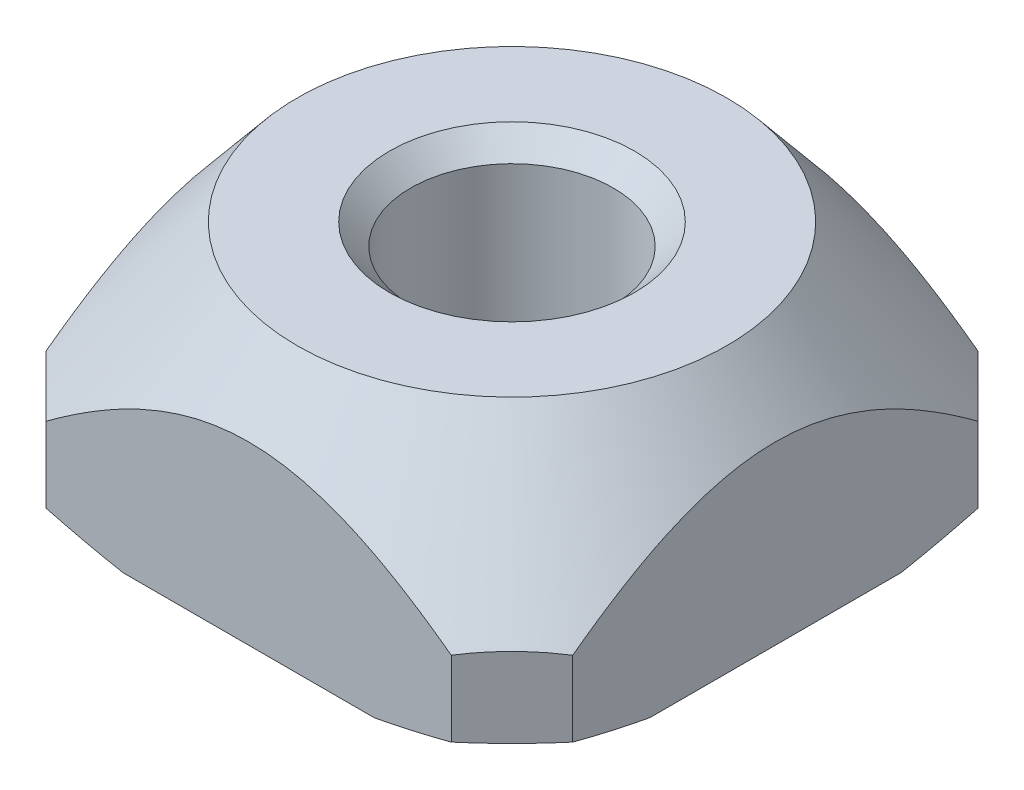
ISO-10303-21;
HEADER;
FILE_DESCRIPTION(('STEP AP214'),'2;1');
FILE_NAME('part.step','',(''),(''),'','','');
FILE_SCHEMA(('AUTOMOTIVE_DESIGN { 1 0 10303 214 1 1 1 1 }'));
ENDSEC;
DATA;
#1=APPLICATION_CONTEXT('core data for automotive mechanical design processes');
#2=APPLICATION_PROTOCOL_DEFINITION('international standard','automotive_design',2000,#1);
#3=PRODUCT_CONTEXT('',#1,'mechanical');
#4=PRODUCT('Part','Part','',(#3));
#5=PRODUCT_RELATED_PRODUCT_CATEGORY('part','',(#4));
#6=PRODUCT_DEFINITION_FORMATION('','',#4);
#7=PRODUCT_DEFINITION_CONTEXT('part definition',#1,'design');
#8=PRODUCT_DEFINITION('design','',#6,#7);
#9=PRODUCT_DEFINITION_SHAPE('','',#8);
#10=(LENGTH_UNIT() NAMED_UNIT(*) SI_UNIT(.MILLI.,.METRE.));
#11=(NAMED_UNIT(*) PLANE_ANGLE_UNIT() SI_UNIT($,.RADIAN.));
#12=(NAMED_UNIT(*) SI_UNIT($,.STERADIAN.) SOLID_ANGLE_UNIT());
#13=UNCERTAINTY_MEASURE_WITH_UNIT(LENGTH_MEASURE(1.E-05),#10,'distance_accuracy_value','');
#14=(GEOMETRIC_REPRESENTATION_CONTEXT(3) GLOBAL_UNCERTAINTY_ASSIGNED_CONTEXT((#13)) GLOBAL_UNIT_ASSIGNED_CONTEXT((#10,
#11,#12)) REPRESENTATION_CONTEXT('',''));
#15=CARTESIAN_POINT('',(0.,0.,0.));
#16=DIRECTION('',(0.,0.,1.));
#17=DIRECTION('',(1.,0.,0.));
#18=AXIS2_PLACEMENT_3D('',#15,#16,#17);
#19=CARTESIAN_POINT('',(0.,5.8,0.));
#20=DIRECTION('',(0.,-1.,0.));
#21=DIRECTION('',(0.,0.,-1.));
#22=AXIS2_PLACEMENT_3D('',#19,#20,#21);
#23=PLANE('',#22);
#24=CARTESIAN_POINT('',(0.,5.80000000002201,0.));
#25=DIRECTION('',(0.,1.,0.));
#26=DIRECTION('',(0.,0.,1.));
#27=AXIS2_PLACEMENT_3D('',#24,#25,#26);
#28=CIRCLE('',#27,3.02499999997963);
#29=CARTESIAN_POINT('',(0.,5.80000000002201,3.02499999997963));
#30=VERTEX_POINT('',#29);
#31=EDGE_CURVE('E19',#30,#30,#28,.F.);
#32=ORIENTED_EDGE('',*,*,#31,.T.);
#33=EDGE_LOOP('',(#32));
#34=FACE_BOUND('',#33,.T.);
#35=CARTESIAN_POINT('',(0.,5.8,0.));
#36=DIRECTION('',(0.,-1.,0.));
#37=DIRECTION('',(0.,0.,-1.));
#38=AXIS2_PLACEMENT_3D('',#35,#36,#37);
#39=CIRCLE('',#38,5.3);
#40=CARTESIAN_POINT('',(0.,5.8,-5.3));
#41=VERTEX_POINT('',#40);
#42=EDGE_CURVE('E445',#41,#41,#39,.T.);
#43=ORIENTED_EDGE('',*,*,#42,.F.);
#44=EDGE_LOOP('',(#43));
#45=FACE_BOUND('',#44,.T.);
#46=ADVANCED_FACE('F16',(#34,#45),#23,.F.);
#47=CARTESIAN_POINT('',(0.,5.80000000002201,0.));
#48=DIRECTION('',(0.,1.,0.));
#49=DIRECTION('',(0.,0.,1.));
#50=AXIS2_PLACEMENT_3D('',#47,#48,#49);
#51=CONICAL_SURFACE('',#50,3.02499999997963,0.785398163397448);
#52=ORIENTED_EDGE('',*,*,#31,.F.);
#53=EDGE_LOOP('',(#52));
#54=FACE_BOUND('',#53,.T.);
#55=CARTESIAN_POINT('',(0.,5.275,0.));
#56=DIRECTION('',(0.,1.,0.));
#57=DIRECTION('',(0.,0.,1.));
#58=AXIS2_PLACEMENT_3D('',#55,#56,#57);
#59=CIRCLE('',#58,2.5);
#60=CARTESIAN_POINT('',(0.,5.275,2.5));
#61=VERTEX_POINT('',#60);
#62=EDGE_CURVE('E147',#61,#61,#59,.F.);
#63=ORIENTED_EDGE('',*,*,#62,.T.);
#64=EDGE_LOOP('',(#63));
#65=FACE_BOUND('',#64,.T.);
#66=ADVANCED_FACE('F355',(#54,#65),#51,.F.);
#67=CARTESIAN_POINT('',(5.00093362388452,37.1474583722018,-6.5));
#68=DIRECTION('',(0.707106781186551,0.,-0.707106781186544));
#69=DIRECTION('',(-0.707106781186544,0.,-0.707106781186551));
#70=AXIS2_PLACEMENT_3D('',#67,#68,#69);
#71=PLANE('',#70);
#72=DIRECTION('',(0.,1.,0.));
#73=VECTOR('',#72,1.);
#74=CARTESIAN_POINT('',(5.00093362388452,5.8,-6.5));
#75=LINE('',#74,#73);
#76=CARTESIAN_POINT('',(5.00093356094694,0.429511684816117,-6.50000006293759));
#77=VERTEX_POINT('',#76);
#78=CARTESIAN_POINT('',(5.00093364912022,2.28669481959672,-6.49999997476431));
#79=VERTEX_POINT('',#78);
#80=EDGE_CURVE('E108',#77,#79,#75,.T.);
#81=ORIENTED_EDGE('',*,*,#80,.T.);
#82=CARTESIAN_POINT('',(6.50000003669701,2.28669480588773,-5.0009335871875));
#83=CARTESIAN_POINT('',(6.43784742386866,2.30045539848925,-5.06308620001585));
#84=CARTESIAN_POINT('',(6.37551621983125,2.31256643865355,-5.12541740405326));
#85=CARTESIAN_POINT('',(6.25056780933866,2.33340084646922,-5.25036581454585));
#86=CARTESIAN_POINT('',(6.18795058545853,2.34212400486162,-5.31298303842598));
#87=CARTESIAN_POINT('',(6.00058150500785,2.36298820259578,-5.50035211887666));
#88=CARTESIAN_POINT('',(5.87552418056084,2.36999999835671,-5.62540944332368));
#89=CARTESIAN_POINT('',(5.62540953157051,2.3700000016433,-5.87552409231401));
#90=CARTESIAN_POINT('',(5.5003522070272,2.36298820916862,-6.00058141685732));
#91=CARTESIAN_POINT('',(5.31298312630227,2.34212401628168,-6.18795049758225));
#92=CARTESIAN_POINT('',(5.25036590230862,2.33340085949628,-6.25056772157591));
#93=CARTESIAN_POINT('',(5.12541749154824,2.31256645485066,-6.37551613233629));
#94=CARTESIAN_POINT('',(5.06308628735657,2.30045541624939,-6.43784733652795));
#95=CARTESIAN_POINT('',(5.00093367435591,2.28669482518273,-6.49999994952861));
#96=B_SPLINE_CURVE_WITH_KNOTS('',3,(#82,#83,#84,#85,#86,#87,#88,#89,#90,#91,#92,#93,#94,#95),
.UNSPECIFIED.,.F.,.F.,(4,2,2,2,2,2,4),(0.,0.26687453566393,0.533765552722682,1.06417199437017,
1.59457843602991,1.86146945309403,2.12834398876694),.UNSPECIFIED.);
#97=CARTESIAN_POINT('',(6.5000000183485,2.28669481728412,-5.00093359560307));
#98=VERTEX_POINT('',#97);
#99=EDGE_CURVE('E101',#98,#79,#96,.T.);
#100=ORIENTED_EDGE('',*,*,#99,.F.);
#101=DIRECTION('',(0.,1.,0.));
#102=VECTOR('',#101,1.);
#103=CARTESIAN_POINT('',(6.5,5.8,-5.00093362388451));
#104=LINE('',#103,#102);
#105=CARTESIAN_POINT('',(6.50000003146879,0.429511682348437,-5.00093359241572));
#106=VERTEX_POINT('',#105);
#107=EDGE_CURVE('E106',#98,#106,#104,.F.);
#108=ORIENTED_EDGE('',*,*,#107,.T.);
#109=CARTESIAN_POINT('',(5.00093349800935,0.429511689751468,-6.50000012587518));
#110=CARTESIAN_POINT('',(5.12577543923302,0.419709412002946,-6.37515818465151));
#111=CARTESIAN_POINT('',(5.25071389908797,0.412329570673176,-6.25021972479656));
#112=CARTESIAN_POINT('',(5.50059054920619,0.402476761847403,-6.00034307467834));
#113=CARTESIAN_POINT('',(5.62552866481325,0.400000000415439,-5.87540495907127));
#114=CARTESIAN_POINT('',(5.8754048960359,0.399999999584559,-5.62552872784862));
#115=CARTESIAN_POINT('',(6.00034301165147,0.40247676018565,-5.50059061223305));
#116=CARTESIAN_POINT('',(6.25021966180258,0.412329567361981,-5.25071396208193));
#117=CARTESIAN_POINT('',(6.37515812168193,0.419709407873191,-5.12577550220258));
#118=CARTESIAN_POINT('',(6.50000006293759,0.429511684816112,-5.00093356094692));
#119=B_SPLINE_CURVE_WITH_KNOTS('',3,(#109,#110,#111,#112,#113,#114,#115,#116,#117,#118),
.UNSPECIFIED.,.F.,.F.,(4,2,2,2,4),(0.,0.530461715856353,1.06051280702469,1.59056389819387,
2.12102561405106),.UNSPECIFIED.);
#120=EDGE_CURVE('E138',#77,#106,#119,.T.);
#121=ORIENTED_EDGE('',*,*,#120,.F.);
#122=EDGE_LOOP('',(#81,#100,#108,#121));
#123=FACE_BOUND('',#122,.T.);
#124=ADVANCED_FACE('F103',(#123),#71,.T.);
#125=CARTESIAN_POINT('',(6.50000000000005,29.8974583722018,5.00093362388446));
#126=DIRECTION('',(0.707106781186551,0.,0.707106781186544));
#127=DIRECTION('',(0.707106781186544,0.,-0.707106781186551));
#128=AXIS2_PLACEMENT_3D('',#125,#126,#127);
#129=PLANE('',#128);
#130=DIRECTION('',(0.,1.,0.));
#131=VECTOR('',#130,1.);
#132=CARTESIAN_POINT('',(6.5,5.8,5.00093362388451));
#133=LINE('',#132,#131);
#134=CARTESIAN_POINT('',(6.50000006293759,0.429511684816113,5.00093356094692));
#135=VERTEX_POINT('',#134);
#136=CARTESIAN_POINT('',(6.5,2.28669481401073,5.00093362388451));
#137=VERTEX_POINT('',#136);
#138=EDGE_CURVE('E120',#135,#137,#133,.T.);
#139=ORIENTED_EDGE('',*,*,#138,.T.);
#140=CARTESIAN_POINT('',(6.5,2.28669481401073,5.00093362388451));
#141=CARTESIAN_POINT('',(6.43784738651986,2.30045540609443,5.06308623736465));
#142=CARTESIAN_POINT('',(6.37551618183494,2.31256644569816,5.12541744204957));
#143=CARTESIAN_POINT('',(6.25056777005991,2.33340085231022,5.25036585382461));
#144=CARTESIAN_POINT('',(6.18795054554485,2.34212401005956,5.31298307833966));
#145=CARTESIAN_POINT('',(6.00058146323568,2.36298820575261,5.50035216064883));
#146=CARTESIAN_POINT('',(5.87552413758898,2.37,5.62540948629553));
#147=CARTESIAN_POINT('',(5.62540948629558,2.37,5.87552413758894));
#148=CARTESIAN_POINT('',(5.50035216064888,2.36298820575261,6.00058146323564));
#149=CARTESIAN_POINT('',(5.31298307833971,2.34212401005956,6.18795054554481));
#150=CARTESIAN_POINT('',(5.25036585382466,2.33340085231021,6.25056777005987));
#151=CARTESIAN_POINT('',(5.12541744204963,2.31256644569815,6.3755161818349));
#152=CARTESIAN_POINT('',(5.0630862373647,2.30045540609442,6.43784738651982));
#153=CARTESIAN_POINT('',(5.00093362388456,2.28669481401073,6.49999999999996));
#154=B_SPLINE_CURVE_WITH_KNOTS('',3,(#140,#141,#142,#143,#144,#145,#146,#147,#148,#149,#150,
#151,#152,#153),.UNSPECIFIED.,.F.,.F.,(4,2,2,2,2,2,4),(0.,0.266874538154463,0.533765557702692,
1.06417200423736,1.59457845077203,1.86146947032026,2.12834400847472),.UNSPECIFIED.);
#155=CARTESIAN_POINT('',(5.00093362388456,2.28669481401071,6.49999999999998));
#156=VERTEX_POINT('',#155);
#157=EDGE_CURVE('E111',#137,#156,#154,.T.);
#158=ORIENTED_EDGE('',*,*,#157,.T.);
#159=DIRECTION('',(0.,1.,0.));
#160=VECTOR('',#159,1.);
#161=CARTESIAN_POINT('',(5.00093362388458,5.8,6.5));
#162=LINE('',#161,#160);
#163=CARTESIAN_POINT('',(5.00093359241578,0.429511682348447,6.50000003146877));
#164=VERTEX_POINT('',#163);
#165=EDGE_CURVE('E257',#156,#164,#162,.F.);
#166=ORIENTED_EDGE('',*,*,#165,.T.);
#167=CARTESIAN_POINT('',(6.50000012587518,0.429511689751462,5.00093349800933));
#168=CARTESIAN_POINT('',(6.37515818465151,0.419709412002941,5.125775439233));
#169=CARTESIAN_POINT('',(6.25021972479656,0.412329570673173,5.25071389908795));
#170=CARTESIAN_POINT('',(6.00034307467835,0.402476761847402,5.50059054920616));
#171=CARTESIAN_POINT('',(5.87540495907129,0.400000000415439,5.62552866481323));
#172=CARTESIAN_POINT('',(5.62552872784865,0.39999999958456,5.87540489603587));
#173=CARTESIAN_POINT('',(5.50059061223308,0.402476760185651,6.00034301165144));
#174=CARTESIAN_POINT('',(5.25071396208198,0.412329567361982,6.25021966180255));
#175=CARTESIAN_POINT('',(5.12577550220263,0.419709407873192,6.3751581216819));
#176=CARTESIAN_POINT('',(5.00093356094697,0.429511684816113,6.50000006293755));
#177=B_SPLINE_CURVE_WITH_KNOTS('',3,(#167,#168,#169,#170,#171,#172,#173,#174,#175,#176),
.UNSPECIFIED.,.F.,.F.,(4,2,2,2,4),(0.,0.530461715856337,1.06051280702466,1.59056389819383,
2.121025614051),.UNSPECIFIED.);
#178=EDGE_CURVE('E272',#135,#164,#177,.T.);
#179=ORIENTED_EDGE('',*,*,#178,.F.);
#180=EDGE_LOOP('',(#139,#158,#166,#179));
#181=FACE_BOUND('',#180,.T.);
#182=ADVANCED_FACE('F327',(#181),#129,.T.);
#183=CARTESIAN_POINT('',(0.,2.26561498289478,0.));
#184=DIRECTION('',(0.,-1.,0.));
#185=DIRECTION('',(0.,0.,-1.));
#186=AXIS2_PLACEMENT_3D('',#183,#184,#185);
#187=CONICAL_SURFACE('',#186,8.218586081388,0.690257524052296);
#188=ORIENTED_EDGE('',*,*,#42,.T.);
#189=EDGE_LOOP('',(#188));
#190=FACE_BOUND('',#189,.T.);
#191=CARTESIAN_POINT('',(-5.00093362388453,2.28669481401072,6.5));
#192=CARTESIAN_POINT('',(-5.06308623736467,2.30045540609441,6.43784738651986));
#193=CARTESIAN_POINT('',(-5.12541744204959,2.31256644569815,6.37551618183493));
#194=CARTESIAN_POINT('',(-5.25036585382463,2.33340085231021,6.2505677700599));
#195=CARTESIAN_POINT('',(-5.31298307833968,2.34212401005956,6.18795054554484));
#196=CARTESIAN_POINT('',(-5.50035216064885,2.3629882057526,6.00058146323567));
#197=CARTESIAN_POINT('',(-5.62540948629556,2.37,5.87552413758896));
#198=CARTESIAN_POINT('',(-5.87552413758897,2.37000000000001,5.62540948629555));
#199=CARTESIAN_POINT('',(-6.00058146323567,2.36298820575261,5.50035216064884));
#200=CARTESIAN_POINT('',(-6.18795054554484,2.34212401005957,5.31298307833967));
#201=CARTESIAN_POINT('',(-6.2505677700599,2.33340085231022,5.25036585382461));
#202=CARTESIAN_POINT('',(-6.37551618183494,2.31256644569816,5.12541744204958));
#203=CARTESIAN_POINT('',(-6.43784738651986,2.30045540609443,5.06308623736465));
#204=CARTESIAN_POINT('',(-6.5,2.28669481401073,5.00093362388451));
#205=B_SPLINE_CURVE_WITH_KNOTS('',3,(#191,#192,#193,#194,#195,#196,#197,#198,#199,#200,#201,
#202,#203,#204),.UNSPECIFIED.,.F.,.F.,(4,2,2,2,2,2,4),(0.,0.26687453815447,0.533765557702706,
1.06417200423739,1.59457845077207,1.8614694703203,2.12834400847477),.UNSPECIFIED.);
#206=CARTESIAN_POINT('',(-5.00093362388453,2.28669481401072,6.5));
#207=VERTEX_POINT('',#206);
#208=CARTESIAN_POINT('',(-6.5,2.28669481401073,5.00093362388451));
#209=VERTEX_POINT('',#208);
#210=EDGE_CURVE('E333',#207,#209,#205,.T.);
#211=ORIENTED_EDGE('',*,*,#210,.F.);
#212=CARTESIAN_POINT('',(-5.00093362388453,2.28669481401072,6.5));
#213=CARTESIAN_POINT('',(-4.89461882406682,2.36519488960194,6.5));
#214=CARTESIAN_POINT('',(-4.78756060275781,2.44268666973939,6.5));
#215=CARTESIAN_POINT('',(-4.57178170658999,2.59536506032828,6.5));
#216=CARTESIAN_POINT('',(-4.46306069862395,2.67055119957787,6.5));
#217=CARTESIAN_POINT('',(-4.13342181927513,2.89269870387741,6.5));
#218=CARTESIAN_POINT('',(-3.90978571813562,3.03568366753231,6.5));
#219=CARTESIAN_POINT('',(-3.4465789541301,3.31215846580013,6.5));
#220=CARTESIAN_POINT('',(-3.20672602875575,3.44517986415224,6.5));
#221=CARTESIAN_POINT('',(-2.7170779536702,3.69103259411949,6.5));
#222=CARTESIAN_POINT('',(-2.46729714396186,3.80389183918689,6.5));
#223=CARTESIAN_POINT('',(-2.03482702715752,3.97262521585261,6.5));
#224=CARTESIAN_POINT('',(-1.85483896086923,4.03539099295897,6.5));
#225=CARTESIAN_POINT('',(-1.49011877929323,4.14544511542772,6.5));
#226=CARTESIAN_POINT('',(-1.30538676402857,4.19273378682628,6.5));
#227=CARTESIAN_POINT('',(-0.934834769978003,4.26884620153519,6.5));
#228=CARTESIAN_POINT('',(-0.749067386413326,4.29792233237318,6.5));
#229=CARTESIAN_POINT('',(-0.375528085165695,4.33690000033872,6.5));
#230=CARTESIAN_POINT('',(-0.187756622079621,4.34680579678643,6.5));
#231=CARTESIAN_POINT('',(0.16789069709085,4.34681251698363,6.5));
#232=CARTESIAN_POINT('',(0.335769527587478,4.33889803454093,6.5));
#233=CARTESIAN_POINT('',(0.670076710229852,4.30766815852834,6.5));
#234=CARTESIAN_POINT('',(0.836505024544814,4.28435236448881,6.5));
#235=CARTESIAN_POINT('',(1.16887468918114,4.22305769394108,6.5));
#236=CARTESIAN_POINT('',(1.3347807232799,4.18488964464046,6.5));
#237=CARTESIAN_POINT('',(1.66300269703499,4.09557989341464,6.5));
#238=CARTESIAN_POINT('',(1.82531875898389,4.04443863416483,6.5));
#239=CARTESIAN_POINT('',(2.26283278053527,3.88965064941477,6.5));
#240=CARTESIAN_POINT('',(2.53410341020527,3.77489830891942,6.5));
#241=CARTESIAN_POINT('',(3.06513239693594,3.5205626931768,6.5));
#242=CARTESIAN_POINT('',(3.32486424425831,3.38092559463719,6.5));
#243=CARTESIAN_POINT('',(3.702501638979,3.16031756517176,6.5));
#244=CARTESIAN_POINT('',(3.82449988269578,3.08620976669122,6.5));
#245=CARTESIAN_POINT('',(4.06621203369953,2.93433161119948,6.5));
#246=CARTESIAN_POINT('',(4.18592578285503,2.85656100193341,6.5));
#247=CARTESIAN_POINT('',(4.422624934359,2.69829475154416,6.5));
#248=CARTESIAN_POINT('',(4.53962131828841,2.6178154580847,6.5));
#249=CARTESIAN_POINT('',(4.77167680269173,2.45417264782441,6.5));
#250=CARTESIAN_POINT('',(4.88673641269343,2.37100985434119,6.5));
#251=CARTESIAN_POINT('',(5.00093362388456,2.2866948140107,6.5));
#252=B_SPLINE_CURVE_WITH_KNOTS('',3,(#212,#213,#214,#215,#216,#217,#218,#219,#220,#221,#222,
#223,#224,#225,#226,#227,#228,#229,#230,#231,#232,#233,#234,#235,#236,#237,#238,#239,#240,#241,
#242,#243,#244,#245,#246,#247,#248,#249,#250,#251),.UNSPECIFIED.,.F.,.F.,(4,2,2,2,2,2,2,2,2,2,2,
2,2,2,2,2,2,2,2,4),(0.,0.396455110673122,0.792990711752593,1.58889552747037,2.41103939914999,
3.23203608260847,3.80332089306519,4.37459366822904,4.93776368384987,5.50080855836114,
6.00427946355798,6.50776346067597,7.01788207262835,7.52798328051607,8.40977024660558,
9.29348810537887,9.72166656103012,10.1498745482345,10.5758468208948,11.0017052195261),.UNSPECIFIED.);
#253=EDGE_CURVE('E258',#207,#156,#252,.T.);
#254=ORIENTED_EDGE('',*,*,#253,.T.);
#255=ORIENTED_EDGE('',*,*,#157,.F.);
#256=CARTESIAN_POINT('',(6.5,2.28669481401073,5.00093362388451));
#257=CARTESIAN_POINT('',(6.5,2.36546542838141,4.89425230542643));
#258=CARTESIAN_POINT('',(6.5,2.44322075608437,4.78682264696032));
#259=CARTESIAN_POINT('',(6.5,2.59640967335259,4.57028828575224));
#260=CARTESIAN_POINT('',(6.5,2.67184277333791,4.46118323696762));
#261=CARTESIAN_POINT('',(6.5,2.89472597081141,4.13033374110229));
#262=CARTESIAN_POINT('',(6.5,3.03816727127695,3.90584895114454));
#263=CARTESIAN_POINT('',(6.5,3.31446263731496,3.44248350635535));
#264=CARTESIAN_POINT('',(6.5,3.44694761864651,3.20338079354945));
#265=CARTESIAN_POINT('',(6.5,3.69182258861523,2.71532773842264));
#266=CARTESIAN_POINT('',(6.5,3.80424366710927,2.46639337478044));
#267=CARTESIAN_POINT('',(6.5,3.96403148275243,2.05685433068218));
#268=CARTESIAN_POINT('',(6.5,4.01970687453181,1.89949160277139));
#269=CARTESIAN_POINT('',(6.5,4.11943260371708,1.58107070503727));
#270=CARTESIAN_POINT('',(6.5,4.16348252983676,1.42001240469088));
#271=CARTESIAN_POINT('',(6.5,4.23795252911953,1.09621460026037));
#272=CARTESIAN_POINT('',(6.5,4.26848771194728,0.93350186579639));
#273=CARTESIAN_POINT('',(6.5,4.31512465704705,0.606006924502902));
#274=CARTESIAN_POINT('',(6.5,4.33122767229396,0.441224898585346));
#275=CARTESIAN_POINT('',(6.5,4.34827314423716,0.109455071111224));
#276=CARTESIAN_POINT('',(6.5,4.34908501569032,-0.0575395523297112));
#277=CARTESIAN_POINT('',(6.5,4.33517110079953,-0.390873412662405));
#278=CARTESIAN_POINT('',(6.5,4.32044494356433,-0.557212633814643));
#279=CARTESIAN_POINT('',(6.5,4.2761251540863,-0.88848991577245));
#280=CARTESIAN_POINT('',(6.5,4.24647760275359,-1.05342067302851));
#281=CARTESIAN_POINT('',(6.5,4.17365597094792,-1.3802445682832));
#282=CARTESIAN_POINT('',(6.5,4.13047995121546,-1.54213726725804));
#283=CARTESIAN_POINT('',(6.5,4.00941900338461,-1.93674499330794));
#284=CARTESIAN_POINT('',(6.5,3.92473121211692,-2.16737187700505));
#285=CARTESIAN_POINT('',(6.5,3.73524387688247,-2.62020320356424));
#286=CARTESIAN_POINT('',(6.5,3.6304297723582,-2.84240140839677));
#287=CARTESIAN_POINT('',(6.5,3.40508735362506,-3.27921361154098));
#288=CARTESIAN_POINT('',(6.5,3.2845244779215,-3.49380956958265));
#289=CARTESIAN_POINT('',(6.5,3.03152298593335,-3.91571764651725));
#290=CARTESIAN_POINT('',(6.5,2.89908838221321,-4.12303219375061));
#291=CARTESIAN_POINT('',(6.5,2.68529870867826,-4.44159950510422));
#292=CARTESIAN_POINT('',(6.5,2.60709917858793,-4.55499497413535));
#293=CARTESIAN_POINT('',(6.5,2.44851798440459,-4.77950010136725));
#294=CARTESIAN_POINT('',(6.5,2.36814750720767,-4.89061765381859));
#295=CARTESIAN_POINT('',(6.5,2.28669482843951,-5.00093360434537));
#296=B_SPLINE_CURVE_WITH_KNOTS('',3,(#256,#257,#258,#259,#260,#261,#262,#263,#264,#265,#266,
#267,#268,#269,#270,#271,#272,#273,#274,#275,#276,#277,#278,#279,#280,#281,#282,#283,#284,#285,
#286,#287,#288,#289,#290,#291,#292,#293,#294,#295),.UNSPECIFIED.,.F.,.F.,(4,2,2,2,2,2,2,2,2,2,2,
2,2,2,2,2,2,2,2,4),(0.,0.39782125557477,0.795725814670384,1.59450470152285,2.41391220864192,
3.23203877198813,3.7324336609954,4.23284625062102,4.72891053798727,5.22493175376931,
5.72518705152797,6.22545429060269,6.727542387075,7.2297024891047,7.96546321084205,
8.70175824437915,9.43969714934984,10.1773875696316,10.590593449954,11.0019709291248),.UNSPECIFIED.);
#297=EDGE_CURVE('E113',#137,#98,#296,.T.);
#298=ORIENTED_EDGE('',*,*,#297,.T.);
#299=ORIENTED_EDGE('',*,*,#99,.T.);
#300=CARTESIAN_POINT('',(5.00093365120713,2.28669479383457,-6.5));
#301=CARTESIAN_POINT('',(4.89461885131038,2.36519486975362,-6.5));
#302=CARTESIAN_POINT('',(4.78756062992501,2.442686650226,-6.5));
#303=CARTESIAN_POINT('',(4.57178173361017,2.59536504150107,-6.5));
#304=CARTESIAN_POINT('',(4.46306072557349,2.67055118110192,-6.5));
#305=CARTESIAN_POINT('',(4.13342184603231,2.89269868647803,-6.5));
#306=CARTESIAN_POINT('',(3.90978574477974,3.03568365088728,-6.5));
#307=CARTESIAN_POINT('',(3.44657898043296,3.31215845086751,-6.5));
#308=CARTESIAN_POINT('',(3.20672605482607,3.44517985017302,-6.5));
#309=CARTESIAN_POINT('',(2.71707797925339,3.69103258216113,-6.5));
#310=CARTESIAN_POINT('',(2.46729716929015,3.80389182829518,-6.5));
#311=CARTESIAN_POINT('',(2.03482705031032,3.97262520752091,-6.5));
#312=CARTESIAN_POINT('',(1.85483898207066,4.0353909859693,-6.5));
#313=CARTESIAN_POINT('',(1.49011879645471,4.1454451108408,-6.5));
#314=CARTESIAN_POINT('',(1.30538677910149,4.19273378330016,-6.5));
#315=CARTESIAN_POINT('',(0.934834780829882,4.26884619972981,-6.5));
#316=CARTESIAN_POINT('',(0.749067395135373,4.29792233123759,-6.5));
#317=CARTESIAN_POINT('',(0.37552808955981,4.33690000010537,-6.5));
#318=CARTESIAN_POINT('',(0.18775662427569,4.34680579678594,-6.5));
#319=CARTESIAN_POINT('',(-0.167890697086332,4.34681251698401,-6.5));
#320=CARTESIAN_POINT('',(-0.335769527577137,4.33889803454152,-6.5));
#321=CARTESIAN_POINT('',(-0.67007671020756,4.30766815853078,-6.5));
#322=CARTESIAN_POINT('',(-0.836505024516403,4.28435236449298,-6.5));
#323=CARTESIAN_POINT('',(-1.16887468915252,4.22305769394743,-6.5));
#324=CARTESIAN_POINT('',(-1.33478072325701,4.1848896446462,-6.5));
#325=CARTESIAN_POINT('',(-1.66300269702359,4.09557989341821,-6.5));
#326=CARTESIAN_POINT('',(-1.82531875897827,4.04443863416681,-6.5));
#327=CARTESIAN_POINT('',(-2.26283278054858,3.88965064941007,-6.5));
#328=CARTESIAN_POINT('',(-2.53410341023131,3.77489830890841,-6.5));
#329=CARTESIAN_POINT('',(-3.06513239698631,3.52056269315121,-6.5));
#330=CARTESIAN_POINT('',(-3.32486424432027,3.38092559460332,-6.5));
#331=CARTESIAN_POINT('',(-3.7025016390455,3.16031756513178,-6.5));
#332=CARTESIAN_POINT('',(-3.82449988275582,3.08620976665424,-6.5));
#333=CARTESIAN_POINT('',(-4.0662120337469,2.93433161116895,-6.5));
#334=CARTESIAN_POINT('',(-4.18592578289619,2.85656100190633,-6.5));
#335=CARTESIAN_POINT('',(-4.422624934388,2.69829475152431,-6.5));
#336=CARTESIAN_POINT('',(-4.53962131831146,2.61781545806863,-6.5));
#337=CARTESIAN_POINT('',(-4.77167680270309,2.45417264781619,-6.5));
#338=CARTESIAN_POINT('',(-4.88673641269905,2.37100985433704,-6.5));
#339=CARTESIAN_POINT('',(-5.00093362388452,2.28669481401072,-6.5));
#340=B_SPLINE_CURVE_WITH_KNOTS('',3,(#300,#301,#302,#303,#304,#305,#306,#307,#308,#309,#310,
#311,#312,#313,#314,#315,#316,#317,#318,#319,#320,#321,#322,#323,#324,#325,#326,#327,#328,#329,
#330,#331,#332,#333,#334,#335,#336,#337,#338,#339),.UNSPECIFIED.,.F.,.F.,(4,2,2,2,2,2,2,2,2,2,2,
2,2,2,2,2,2,2,2,4),(0.,0.396455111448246,0.792990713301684,1.5888955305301,2.41103940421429,
3.23203608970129,3.80332090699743,4.37459368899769,4.93776371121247,5.50080859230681,
6.00427949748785,6.50776349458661,7.01788210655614,7.52798331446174,8.40977028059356,
9.29348813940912,9.72166659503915,10.1498745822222,10.5758468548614,11.0017052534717),.UNSPECIFIED.);
#341=CARTESIAN_POINT('',(-5.00093362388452,2.28669481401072,-6.5));
#342=VERTEX_POINT('',#341);
#343=EDGE_CURVE('E144',#79,#342,#340,.T.);
#344=ORIENTED_EDGE('',*,*,#343,.T.);
#345=CARTESIAN_POINT('',(-6.5,2.28669481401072,-5.00093362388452));
#346=CARTESIAN_POINT('',(-6.43784738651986,2.30045540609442,-5.06308623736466));
#347=CARTESIAN_POINT('',(-6.37551618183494,2.31256644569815,-5.12541744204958));
#348=CARTESIAN_POINT('',(-6.2505677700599,2.33340085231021,-5.25036585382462));
#349=CARTESIAN_POINT('',(-6.18795054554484,2.34212401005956,-5.31298307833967));
#350=CARTESIAN_POINT('',(-6.00058146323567,2.36298820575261,-5.50035216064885));
#351=CARTESIAN_POINT('',(-5.87552413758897,2.37,-5.62540948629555));
#352=CARTESIAN_POINT('',(-5.62540948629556,2.37000000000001,-5.87552413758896));
#353=CARTESIAN_POINT('',(-5.50035216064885,2.36298820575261,-6.00058146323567));
#354=CARTESIAN_POINT('',(-5.31298307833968,2.34212401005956,-6.18795054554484));
#355=CARTESIAN_POINT('',(-5.25036585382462,2.33340085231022,-6.2505677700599));
#356=CARTESIAN_POINT('',(-5.12541744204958,2.31256644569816,-6.37551618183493));
#357=CARTESIAN_POINT('',(-5.06308623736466,2.30045540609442,-6.43784738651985));
#358=CARTESIAN_POINT('',(-5.00093362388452,2.28669481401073,-6.5));
#359=B_SPLINE_CURVE_WITH_KNOTS('',3,(#345,#346,#347,#348,#349,#350,#351,#352,#353,#354,#355,
#356,#357,#358),.UNSPECIFIED.,.F.,.F.,(4,2,2,2,2,2,4),(0.,0.26687453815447,0.533765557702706,
1.06417200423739,1.59457845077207,1.8614694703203,2.12834400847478),.UNSPECIFIED.);
#360=CARTESIAN_POINT('',(-6.5,2.28669481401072,-5.00093362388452));
#361=VERTEX_POINT('',#360);
#362=EDGE_CURVE('E150',#361,#342,#359,.T.);
#363=ORIENTED_EDGE('',*,*,#362,.F.);
#364=CARTESIAN_POINT('',(-6.5,2.28669481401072,-5.00093362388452));
#365=CARTESIAN_POINT('',(-6.5,2.36546542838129,-4.89425230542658));
#366=CARTESIAN_POINT('',(-6.5,2.44322075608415,-4.78682264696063));
#367=CARTESIAN_POINT('',(-6.5,2.59640967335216,-4.57028828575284));
#368=CARTESIAN_POINT('',(-6.5,2.67184277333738,-4.46118323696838));
#369=CARTESIAN_POINT('',(-6.5,2.89472597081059,-4.13033374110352));
#370=CARTESIAN_POINT('',(-6.5,3.03816727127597,-3.90584895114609));
#371=CARTESIAN_POINT('',(-6.5,3.31446263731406,-3.44248350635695));
#372=CARTESIAN_POINT('',(-6.5,3.44694761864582,-3.20338079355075));
#373=CARTESIAN_POINT('',(-6.5,3.69182258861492,-2.71532773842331));
#374=CARTESIAN_POINT('',(-6.5,3.80424366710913,-2.46639337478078));
#375=CARTESIAN_POINT('',(-6.5,3.96403148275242,-2.05685433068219));
#376=CARTESIAN_POINT('',(-6.5,4.0197068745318,-1.89949160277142));
#377=CARTESIAN_POINT('',(-6.5,4.11943260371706,-1.58107070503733));
#378=CARTESIAN_POINT('',(-6.5,4.16348252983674,-1.42001240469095));
#379=CARTESIAN_POINT('',(-6.5,4.23795252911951,-1.09621460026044));
#380=CARTESIAN_POINT('',(-6.5,4.26848771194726,-0.933501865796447));
#381=CARTESIAN_POINT('',(-6.5,4.31512465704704,-0.606006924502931));
#382=CARTESIAN_POINT('',(-6.5,4.33122767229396,-0.441224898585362));
#383=CARTESIAN_POINT('',(-6.5,4.34827314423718,-0.109455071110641));
#384=CARTESIAN_POINT('',(-6.5,4.34908501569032,0.0575395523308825));
#385=CARTESIAN_POINT('',(-6.5,4.33517110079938,0.390873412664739));
#386=CARTESIAN_POINT('',(-6.5,4.32044494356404,0.557212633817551));
#387=CARTESIAN_POINT('',(-6.5,4.2761251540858,0.888489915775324));
#388=CARTESIAN_POINT('',(-6.5,4.24647760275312,1.05342067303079));
#389=CARTESIAN_POINT('',(-6.5,4.17365597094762,1.38024456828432));
#390=CARTESIAN_POINT('',(-6.5,4.13047995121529,1.5421372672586));
#391=CARTESIAN_POINT('',(-6.5,4.00941900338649,1.93674499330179));
#392=CARTESIAN_POINT('',(-6.5,3.92473121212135,2.16737187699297));
#393=CARTESIAN_POINT('',(-6.5,3.73524387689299,2.62020320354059));
#394=CARTESIAN_POINT('',(-6.5,3.63042977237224,2.8424014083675));
#395=CARTESIAN_POINT('',(-6.5,3.40508735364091,3.2792136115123));
#396=CARTESIAN_POINT('',(-6.5,3.2845244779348,3.49380956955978));
#397=CARTESIAN_POINT('',(-6.5,3.03152298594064,3.91571764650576));
#398=CARTESIAN_POINT('',(-6.5,2.89908838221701,4.1230321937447));
#399=CARTESIAN_POINT('',(-6.5,2.68529870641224,4.44159950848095));
#400=CARTESIAN_POINT('',(-6.5,2.6070991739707,4.55499498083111));
#401=CARTESIAN_POINT('',(-6.5,2.44851797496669,4.77950011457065));
#402=CARTESIAN_POINT('',(-6.5,2.36814749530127,4.89061767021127));
#403=CARTESIAN_POINT('',(-6.5,2.28669481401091,5.00093362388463));
#404=B_SPLINE_CURVE_WITH_KNOTS('',3,(#364,#365,#366,#367,#368,#369,#370,#371,#372,#373,#374,
#375,#376,#377,#378,#379,#380,#381,#382,#383,#384,#385,#386,#387,#388,#389,#390,#391,#392,#393,
#394,#395,#396,#397,#398,#399,#400,#401,#402,#403),.UNSPECIFIED.,.F.,.F.,(4,2,2,2,2,2,2,2,2,2,2,
2,2,2,2,2,2,2,2,4),(0.,0.397821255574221,0.795725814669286,1.59450470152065,2.41391220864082,
3.23203877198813,3.73243366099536,4.23284625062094,4.72891053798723,5.22493175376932,
5.72518705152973,6.2254542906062,6.72754238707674,7.22970248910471,7.96546321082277,
8.70175824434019,9.43969714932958,10.1773875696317,10.5905934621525,11.0019709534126),.UNSPECIFIED.);
#405=EDGE_CURVE('E218',#361,#209,#404,.T.);
#406=ORIENTED_EDGE('',*,*,#405,.T.);
#407=EDGE_LOOP('',(#211,#254,#255,#298,#299,#344,#363,#406));
#408=FACE_BOUND('',#407,.T.);
#409=ADVANCED_FACE('F115',(#190,#408),#187,.T.);
#410=CARTESIAN_POINT('',(-5.00093362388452,29.8974583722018,6.5));
#411=DIRECTION('',(-0.707106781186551,0.,0.707106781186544));
#412=DIRECTION('',(0.707106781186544,0.,0.707106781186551));
#413=AXIS2_PLACEMENT_3D('',#410,#411,#412);
#414=PLANE('',#413);
#415=DIRECTION('',(0.,1.,0.));
#416=VECTOR('',#415,1.);
#417=CARTESIAN_POINT('',(-5.00093362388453,5.8,6.5));
#418=LINE('',#417,#416);
#419=CARTESIAN_POINT('',(-5.00093356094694,0.429511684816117,6.50000006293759));
#420=VERTEX_POINT('',#419);
#421=EDGE_CURVE('E134',#420,#207,#418,.T.);
#422=ORIENTED_EDGE('',*,*,#421,.T.);
#423=ORIENTED_EDGE('',*,*,#210,.T.);
#424=DIRECTION('',(0.,1.,0.));
#425=VECTOR('',#424,1.);
#426=CARTESIAN_POINT('',(-6.5,5.8,5.00093362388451));
#427=LINE('',#426,#425);
#428=CARTESIAN_POINT('',(-6.49999996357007,0.429511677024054,5.00093366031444));
#429=VERTEX_POINT('',#428);
#430=EDGE_CURVE('E217',#209,#429,#427,.F.);
#431=ORIENTED_EDGE('',*,*,#430,.T.);
#432=CARTESIAN_POINT('',(-5.00093349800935,0.429511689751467,6.50000012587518));
#433=CARTESIAN_POINT('',(-5.12577542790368,0.419709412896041,6.37515819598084));
#434=CARTESIAN_POINT('',(-5.25071387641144,0.412329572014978,6.25021974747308));
#435=CARTESIAN_POINT('',(-5.50059050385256,0.402476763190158,6.00034312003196));
#436=CARTESIAN_POINT('',(-5.62552860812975,0.400000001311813,5.87540501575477));
#437=CARTESIAN_POINT('',(-5.87540481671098,0.399999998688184,5.62552880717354));
#438=CARTESIAN_POINT('',(-6.00034292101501,0.402476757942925,5.5005907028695));
#439=CARTESIAN_POINT('',(-6.25021954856,0.412329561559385,5.25071407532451));
#440=CARTESIAN_POINT('',(-6.37515799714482,0.419709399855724,5.12577562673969));
#441=CARTESIAN_POINT('',(-6.49999992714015,0.429511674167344,5.00093369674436));
#442=B_SPLINE_CURVE_WITH_KNOTS('',3,(#432,#433,#434,#435,#436,#437,#438,#439,#440,#441),
.UNSPECIFIED.,.F.,.F.,(4,2,2,2,4),(0.,0.530461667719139,1.0605127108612,1.5905637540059,
2.12102542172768),.UNSPECIFIED.);
#443=EDGE_CURVE('E235',#420,#429,#442,.T.);
#444=ORIENTED_EDGE('',*,*,#443,.F.);
#445=EDGE_LOOP('',(#422,#423,#431,#444));
#446=FACE_BOUND('',#445,.T.);
#447=ADVANCED_FACE('F326',(#446),#414,.T.);
#448=CARTESIAN_POINT('',(-6.50000000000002,29.8974583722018,-5.0009336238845));
#449=DIRECTION('',(-0.707106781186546,0.,-0.707106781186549));
#450=DIRECTION('',(-0.707106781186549,0.,0.707106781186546));
#451=AXIS2_PLACEMENT_3D('',#448,#449,#450);
#452=PLANE('',#451);
#453=DIRECTION('',(0.,1.,0.));
#454=VECTOR('',#453,1.);
#455=CARTESIAN_POINT('',(-6.5,5.8,-5.00093362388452));
#456=LINE('',#455,#454);
#457=CARTESIAN_POINT('',(-6.50000006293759,0.429511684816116,-5.00093356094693));
#458=VERTEX_POINT('',#457);
#459=EDGE_CURVE('E395',#458,#361,#456,.T.);
#460=ORIENTED_EDGE('',*,*,#459,.T.);
#461=ORIENTED_EDGE('',*,*,#362,.T.);
#462=DIRECTION('',(0.,1.,0.));
#463=VECTOR('',#462,1.);
#464=CARTESIAN_POINT('',(-5.00093362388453,5.8,-6.5));
#465=LINE('',#464,#463);
#466=CARTESIAN_POINT('',(-5.00093369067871,0.42951169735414,-6.5));
#467=VERTEX_POINT('',#466);
#468=EDGE_CURVE('E139',#342,#467,#465,.F.);
#469=ORIENTED_EDGE('',*,*,#468,.T.);
#470=CARTESIAN_POINT('',(-6.50000012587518,0.429511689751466,-5.00093349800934));
#471=CARTESIAN_POINT('',(-6.37515819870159,0.419709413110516,-5.12577542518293));
#472=CARTESIAN_POINT('',(-6.25021975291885,0.41232957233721,-5.25071387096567));
#473=CARTESIAN_POINT('',(-6.00034313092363,0.40247676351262,-5.50059049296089));
#474=CARTESIAN_POINT('',(-5.87540502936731,0.400000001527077,-5.62552859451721));
#475=CARTESIAN_POINT('',(-5.62552882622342,0.399999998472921,-5.8754047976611));
#476=CARTESIAN_POINT('',(-5.50059072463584,0.402476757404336,-6.00034289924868));
#477=CARTESIAN_POINT('',(-5.2507141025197,0.412329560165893,-6.25021952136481));
#478=CARTESIAN_POINT('',(-5.12577565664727,0.41970939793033,-6.37515796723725));
#479=CARTESIAN_POINT('',(-5.00093372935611,0.429511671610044,-6.49999989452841));
#480=B_SPLINE_CURVE_WITH_KNOTS('',3,(#470,#471,#472,#473,#474,#475,#476,#477,#478,#479),
.UNSPECIFIED.,.F.,.F.,(4,2,2,2,4),(0.,0.530461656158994,1.06051268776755,1.59056371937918,
2.12102537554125),.UNSPECIFIED.);
#481=EDGE_CURVE('E181',#458,#467,#480,.T.);
#482=ORIENTED_EDGE('',*,*,#481,.F.);
#483=EDGE_LOOP('',(#460,#461,#469,#482));
#484=FACE_BOUND('',#483,.T.);
#485=ADVANCED_FACE('F376',(#484),#452,.T.);
#486=CARTESIAN_POINT('',(0.,5.8,0.));
#487=DIRECTION('',(0.,1.,0.));
#488=DIRECTION('',(0.,0.,1.));
#489=AXIS2_PLACEMENT_3D('',#486,#487,#488);
#490=CYLINDRICAL_SURFACE('',#489,2.5);
#491=ORIENTED_EDGE('',*,*,#62,.F.);
#492=EDGE_LOOP('',(#491));
#493=FACE_BOUND('',#492,.T.);
#494=CARTESIAN_POINT('',(0.,0.,0.));
#495=DIRECTION('',(0.,1.,0.));
#496=DIRECTION('',(0.,0.,1.));
#497=AXIS2_PLACEMENT_3D('',#494,#495,#496);
#498=CIRCLE('',#497,2.5);
#499=CARTESIAN_POINT('',(0.,0.,2.5));
#500=VERTEX_POINT('',#499);
#501=EDGE_CURVE('E167',#500,#500,#498,.T.);
#502=ORIENTED_EDGE('',*,*,#501,.F.);
#503=EDGE_LOOP('',(#502));
#504=FACE_BOUND('',#503,.T.);
#505=ADVANCED_FACE('F374',(#493,#504),#490,.F.);
#506=CARTESIAN_POINT('',(-6.5,5.8,-6.5));
#507=DIRECTION('',(0.,0.,1.));
#508=DIRECTION('',(1.,0.,0.));
#509=AXIS2_PLACEMENT_3D('',#506,#507,#508);
#510=PLANE('',#509);
#511=ORIENTED_EDGE('',*,*,#468,.F.);
#512=ORIENTED_EDGE('',*,*,#343,.F.);
#513=ORIENTED_EDGE('',*,*,#80,.F.);
#514=CARTESIAN_POINT('',(3.0967725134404,0.,-6.5));
#515=CARTESIAN_POINT('',(3.25681087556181,0.0295324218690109,-6.5));
#516=CARTESIAN_POINT('',(3.41650959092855,0.0608632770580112,-6.5));
#517=CARTESIAN_POINT('',(3.73518371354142,0.126759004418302,-6.5));
#518=CARTESIAN_POINT('',(3.89415934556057,0.161322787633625,-6.5));
#519=CARTESIAN_POINT('',(4.21144082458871,0.233339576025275,-6.5));
#520=CARTESIAN_POINT('',(4.36974671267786,0.270792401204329,-6.5));
#521=CARTESIAN_POINT('',(4.68578021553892,0.3482890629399,-6.5));
#522=CARTESIAN_POINT('',(4.84350761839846,0.388333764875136,-6.5));
#523=CARTESIAN_POINT('',(5.00093343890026,0.429511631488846,-6.5));
#524=B_SPLINE_CURVE_WITH_KNOTS('',3,(#514,#515,#516,#517,#518,#519,#520,#521,#522,#523),
.UNSPECIFIED.,.F.,.F.,(4,2,2,2,4),(0.,0.488199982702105,0.97623611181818,1.46424185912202,
1.95241139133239),.UNSPECIFIED.);
#525=CARTESIAN_POINT('',(3.0967725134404,0.,-6.5));
#526=VERTEX_POINT('',#525);
#527=EDGE_CURVE('E143',#526,#77,#524,.T.);
#528=ORIENTED_EDGE('',*,*,#527,.F.);
#529=DIRECTION('',(1.,0.,0.));
#530=VECTOR('',#529,1.);
#531=CARTESIAN_POINT('',(0.,0.,-6.5));
#532=LINE('',#531,#530);
#533=CARTESIAN_POINT('',(-3.0967725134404,0.,-6.5));
#534=VERTEX_POINT('',#533);
#535=EDGE_CURVE('E166',#534,#526,#532,.T.);
#536=ORIENTED_EDGE('',*,*,#535,.F.);
#537=CARTESIAN_POINT('',(-5.00093375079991,0.429511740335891,-6.49999996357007));
#538=CARTESIAN_POINT('',(-4.84350790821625,0.388333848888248,-6.4999999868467));
#539=CARTESIAN_POINT('',(-4.68578048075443,0.348289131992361,-6.49999999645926));
#540=CARTESIAN_POINT('',(-4.36974692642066,0.270792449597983,-6.50000000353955));
#541=CARTESIAN_POINT('',(-4.21144101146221,0.233339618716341,-6.50000000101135));
#542=CARTESIAN_POINT('',(-3.89415947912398,0.16132281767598,-6.49999999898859));
#543=CARTESIAN_POINT('',(-3.73518382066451,0.126759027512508,-6.49999999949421));
#544=CARTESIAN_POINT('',(-3.41650964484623,0.0608632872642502,-6.50000000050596));
#545=CARTESIAN_POINT('',(-3.25681090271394,0.0295324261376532,-6.5000000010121));
#546=CARTESIAN_POINT('',(-3.0967725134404,0.,-6.5));
#547=B_SPLINE_CURVE_WITH_KNOTS('',3,(#537,#538,#539,#540,#541,#542,#543,#544,#545,#546),
.UNSPECIFIED.,.F.,.F.,(4,2,2,2,4),(0.,0.488169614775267,0.976175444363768,1.46421165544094,
1.95241172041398),.UNSPECIFIED.);
#548=EDGE_CURVE('E171',#467,#534,#547,.T.);
#549=ORIENTED_EDGE('',*,*,#548,.F.);
#550=EDGE_LOOP('',(#511,#512,#513,#528,#536,#549));
#551=FACE_BOUND('',#550,.T.);
#552=ADVANCED_FACE('F188',(#551),#510,.F.);
#553=CARTESIAN_POINT('',(0.,0.432088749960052,0.));
#554=DIRECTION('',(0.,1.,0.));
#555=DIRECTION('',(0.,0.,1.));
#556=AXIS2_PLACEMENT_3D('',#553,#554,#555);
#557=CONICAL_SURFACE('',#556,8.207186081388,1.1655375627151);
#558=ORIENTED_EDGE('',*,*,#527,.T.);
#559=ORIENTED_EDGE('',*,*,#120,.T.);
#560=CARTESIAN_POINT('',(6.50000003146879,0.429511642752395,-5.0009335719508));
#561=CARTESIAN_POINT('',(6.50000001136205,0.388333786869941,-4.84350773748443));
#562=CARTESIAN_POINT('',(6.50000000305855,0.348289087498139,-4.68578032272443));
#563=CARTESIAN_POINT('',(6.49999999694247,0.27079242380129,-4.36974679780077));
#564=CARTESIAN_POINT('',(6.49999999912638,0.233339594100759,-4.21144089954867));
#565=CARTESIAN_POINT('',(6.50000000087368,0.161322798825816,-3.89415939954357));
#566=CARTESIAN_POINT('',(6.50000000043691,0.126759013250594,-3.73518375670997));
#567=CARTESIAN_POINT('',(6.49999999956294,0.0608632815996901,-3.4165096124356));
#568=CARTESIAN_POINT('',(6.49999999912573,0.0295324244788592,-3.25681088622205));
#569=CARTESIAN_POINT('',(6.5,0.,-3.0967725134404));
#570=B_SPLINE_CURVE_WITH_KNOTS('',3,(#560,#561,#562,#563,#564,#565,#566,#567,#568,#569),
.UNSPECIFIED.,.F.,.F.,(4,2,2,2,4),(0.,0.488169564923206,0.976175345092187,1.46421150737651,
1.95241152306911),.UNSPECIFIED.);
#571=CARTESIAN_POINT('',(6.5,0.,-3.09677251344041));
#572=VERTEX_POINT('',#571);
#573=EDGE_CURVE('E125',#106,#572,#570,.T.);
#574=ORIENTED_EDGE('',*,*,#573,.T.);
#575=CARTESIAN_POINT('',(0.,0.,0.));
#576=DIRECTION('',(0.,1.,0.));
#577=DIRECTION('',(0.,0.,1.));
#578=AXIS2_PLACEMENT_3D('',#575,#576,#577);
#579=CIRCLE('',#578,7.2);
#580=EDGE_CURVE('E162',#526,#572,#579,.F.);
#581=ORIENTED_EDGE('',*,*,#580,.F.);
#582=EDGE_LOOP('',(#558,#559,#574,#581));
#583=FACE_BOUND('',#582,.T.);
#584=ADVANCED_FACE('F294',(#583),#557,.T.);
#585=CARTESIAN_POINT('',(6.5,5.8,6.5));
#586=DIRECTION('',(-1.,0.,0.));
#587=DIRECTION('',(0.,0.,1.));
#588=AXIS2_PLACEMENT_3D('',#585,#586,#587);
#589=PLANE('',#588);
#590=ORIENTED_EDGE('',*,*,#107,.F.);
#591=ORIENTED_EDGE('',*,*,#297,.F.);
#592=ORIENTED_EDGE('',*,*,#138,.F.);
#593=CARTESIAN_POINT('',(6.5,0.,3.09677251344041));
#594=CARTESIAN_POINT('',(6.5,0.0295324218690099,3.25681087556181));
#595=CARTESIAN_POINT('',(6.5,0.06086327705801,3.41650959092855));
#596=CARTESIAN_POINT('',(6.5,0.1267590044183,3.73518371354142));
#597=CARTESIAN_POINT('',(6.5,0.161322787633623,3.89415934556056));
#598=CARTESIAN_POINT('',(6.5,0.233339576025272,4.2114408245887));
#599=CARTESIAN_POINT('',(6.5,0.270792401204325,4.36974671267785));
#600=CARTESIAN_POINT('',(6.5,0.348289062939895,4.68578021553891));
#601=CARTESIAN_POINT('',(6.5,0.388333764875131,4.84350761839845));
#602=CARTESIAN_POINT('',(6.5,0.429511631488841,5.00093343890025));
#603=B_SPLINE_CURVE_WITH_KNOTS('',3,(#593,#594,#595,#596,#597,#598,#599,#600,#601,#602),
.UNSPECIFIED.,.F.,.F.,(4,2,2,2,4),(0.,0.488199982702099,0.976236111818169,1.46424185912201,
1.95241139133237),.UNSPECIFIED.);
#604=CARTESIAN_POINT('',(6.5,0.,3.09677251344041));
#605=VERTEX_POINT('',#604);
#606=EDGE_CURVE('E130',#605,#135,#603,.T.);
#607=ORIENTED_EDGE('',*,*,#606,.F.);
#608=DIRECTION('',(0.,0.,-1.));
#609=VECTOR('',#608,1.);
#610=CARTESIAN_POINT('',(6.5,0.,0.));
#611=LINE('',#610,#609);
#612=EDGE_CURVE('E161',#572,#605,#611,.F.);
#613=ORIENTED_EDGE('',*,*,#612,.F.);
#614=ORIENTED_EDGE('',*,*,#573,.F.);
#615=EDGE_LOOP('',(#590,#591,#592,#607,#613,#614));
#616=FACE_BOUND('',#615,.T.);
#617=ADVANCED_FACE('F123',(#616),#589,.F.);
#618=CARTESIAN_POINT('',(0.,0.432088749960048,0.));
#619=DIRECTION('',(0.,1.,0.));
#620=DIRECTION('',(0.,0.,1.));
#621=AXIS2_PLACEMENT_3D('',#618,#619,#620);
#622=CONICAL_SURFACE('',#621,8.20718608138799,1.1655375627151);
#623=ORIENTED_EDGE('',*,*,#606,.T.);
#624=ORIENTED_EDGE('',*,*,#178,.T.);
#625=CARTESIAN_POINT('',(5.00093356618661,0.429511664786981,6.5));
#626=CARTESIAN_POINT('',(4.84350773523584,0.388333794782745,6.5));
#627=CARTESIAN_POINT('',(4.68578032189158,0.348289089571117,6.5));
#628=CARTESIAN_POINT('',(4.36974679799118,0.270792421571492,6.5));
#629=CARTESIAN_POINT('',(4.21144089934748,0.233339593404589,6.5));
#630=CARTESIAN_POINT('',(3.89415939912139,0.161322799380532,6.5));
#631=CARTESIAN_POINT('',(3.73518375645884,0.126759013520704,6.5));
#632=CARTESIAN_POINT('',(3.41650961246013,0.0608632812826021,6.5));
#633=CARTESIAN_POINT('',(3.25681088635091,0.02953242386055,6.5));
#634=CARTESIAN_POINT('',(3.09677251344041,0.,6.5));
#635=B_SPLINE_CURVE_WITH_KNOTS('',3,(#625,#626,#627,#628,#629,#630,#631,#632,#633,#634),
.UNSPECIFIED.,.F.,.F.,(4,2,2,2,4),(0.,0.488169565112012,0.97617534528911,1.46421150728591,
1.95241152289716),.UNSPECIFIED.);
#636=CARTESIAN_POINT('',(3.09677251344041,0.,6.5));
#637=VERTEX_POINT('',#636);
#638=EDGE_CURVE('E250',#164,#637,#635,.T.);
#639=ORIENTED_EDGE('',*,*,#638,.T.);
#640=CARTESIAN_POINT('',(0.,0.,0.));
#641=DIRECTION('',(0.,1.,0.));
#642=DIRECTION('',(0.,0.,1.));
#643=AXIS2_PLACEMENT_3D('',#640,#641,#642);
#644=CIRCLE('',#643,7.2);
#645=EDGE_CURVE('E157',#605,#637,#644,.F.);
#646=ORIENTED_EDGE('',*,*,#645,.F.);
#647=EDGE_LOOP('',(#623,#624,#639,#646));
#648=FACE_BOUND('',#647,.T.);
#649=ADVANCED_FACE('F264',(#648),#622,.T.);
#650=CARTESIAN_POINT('',(-6.5,5.8,6.5));
#651=DIRECTION('',(0.,0.,-1.));
#652=DIRECTION('',(-1.,0.,0.));
#653=AXIS2_PLACEMENT_3D('',#650,#651,#652);
#654=PLANE('',#653);
#655=ORIENTED_EDGE('',*,*,#165,.F.);
#656=ORIENTED_EDGE('',*,*,#253,.F.);
#657=ORIENTED_EDGE('',*,*,#421,.F.);
#658=CARTESIAN_POINT('',(-3.09677251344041,0.,6.5));
#659=CARTESIAN_POINT('',(-3.25681087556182,0.0295324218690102,6.5));
#660=CARTESIAN_POINT('',(-3.41650959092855,0.0608632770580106,6.5));
#661=CARTESIAN_POINT('',(-3.73518371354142,0.126759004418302,6.5));
#662=CARTESIAN_POINT('',(-3.89415934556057,0.161322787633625,6.5));
#663=CARTESIAN_POINT('',(-4.21144082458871,0.233339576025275,6.5));
#664=CARTESIAN_POINT('',(-4.36974671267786,0.270792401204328,6.5));
#665=CARTESIAN_POINT('',(-4.68578021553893,0.348289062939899,6.5));
#666=CARTESIAN_POINT('',(-4.84350761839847,0.388333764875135,6.5));
#667=CARTESIAN_POINT('',(-5.00093343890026,0.429511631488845,6.5));
#668=B_SPLINE_CURVE_WITH_KNOTS('',3,(#658,#659,#660,#661,#662,#663,#664,#665,#666,#667),
.UNSPECIFIED.,.F.,.F.,(4,2,2,2,4),(0.,0.488199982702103,0.976236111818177,1.46424185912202,
1.95241139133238),.UNSPECIFIED.);
#669=CARTESIAN_POINT('',(-3.09677251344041,0.,6.5));
#670=VERTEX_POINT('',#669);
#671=EDGE_CURVE('E242',#670,#420,#668,.T.);
#672=ORIENTED_EDGE('',*,*,#671,.F.);
#673=DIRECTION('',(1.,0.,0.));
#674=VECTOR('',#673,1.);
#675=CARTESIAN_POINT('',(0.,0.,6.5));
#676=LINE('',#675,#674);
#677=EDGE_CURVE('E156',#637,#670,#676,.F.);
#678=ORIENTED_EDGE('',*,*,#677,.F.);
#679=ORIENTED_EDGE('',*,*,#638,.F.);
#680=EDGE_LOOP('',(#655,#656,#657,#672,#678,#679));
#681=FACE_BOUND('',#680,.T.);
#682=ADVANCED_FACE('F229',(#681),#654,.F.);
#683=CARTESIAN_POINT('',(0.,0.432088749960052,0.));
#684=DIRECTION('',(0.,1.,0.));
#685=DIRECTION('',(-1.,0.,0.));
#686=AXIS2_PLACEMENT_3D('',#683,#684,#685);
#687=CONICAL_SURFACE('',#686,8.207186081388,1.1655375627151);
#688=CARTESIAN_POINT('',(-6.5,0.429511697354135,5.0009336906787));
#689=CARTESIAN_POINT('',(-6.5,0.388333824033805,4.84350784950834));
#690=CARTESIAN_POINT('',(-6.5,0.348289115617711,4.68578042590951));
#691=CARTESIAN_POINT('',(-6.5,0.270792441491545,4.36974688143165));
#692=CARTESIAN_POINT('',(-6.5,0.233339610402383,4.21144097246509));
#693=CARTESIAN_POINT('',(-6.5,0.161322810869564,3.89415945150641));
#694=CARTESIAN_POINT('',(-6.5,0.126759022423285,3.73518379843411));
#695=CARTESIAN_POINT('',(-6.5,0.0608632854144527,3.41650963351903));
#696=CARTESIAN_POINT('',(-6.5,0.0295324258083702,3.25681089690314));
#697=CARTESIAN_POINT('',(-6.5,0.,3.0967725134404));
#698=B_SPLINE_CURVE_WITH_KNOTS('',3,(#688,#689,#690,#691,#692,#693,#694,#695,#696,#697),
.UNSPECIFIED.,.F.,.F.,(4,2,2,2,4),(0.,0.48816959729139,0.976175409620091,1.4642116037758,
1.95241165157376),.UNSPECIFIED.);
#699=CARTESIAN_POINT('',(-6.5,0.,3.0967725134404));
#700=VERTEX_POINT('',#699);
#701=EDGE_CURVE('E210',#429,#700,#698,.T.);
#702=ORIENTED_EDGE('',*,*,#701,.T.);
#703=CARTESIAN_POINT('',(0.,0.,0.));
#704=DIRECTION('',(0.,1.,0.));
#705=DIRECTION('',(-1.,0.,0.));
#706=AXIS2_PLACEMENT_3D('',#703,#704,#705);
#707=CIRCLE('',#706,7.2);
#708=EDGE_CURVE('E152',#670,#700,#707,.F.);
#709=ORIENTED_EDGE('',*,*,#708,.F.);
#710=ORIENTED_EDGE('',*,*,#671,.T.);
#711=ORIENTED_EDGE('',*,*,#443,.T.);
#712=EDGE_LOOP('',(#702,#709,#710,#711));
#713=FACE_BOUND('',#712,.T.);
#714=ADVANCED_FACE('F225',(#713),#687,.T.);
#715=CARTESIAN_POINT('',(-6.5,5.8,6.5));
#716=DIRECTION('',(1.,0.,0.));
#717=DIRECTION('',(0.,0.,-1.));
#718=AXIS2_PLACEMENT_3D('',#715,#716,#717);
#719=PLANE('',#718);
#720=ORIENTED_EDGE('',*,*,#430,.F.);
#721=ORIENTED_EDGE('',*,*,#405,.F.);
#722=ORIENTED_EDGE('',*,*,#459,.F.);
#723=CARTESIAN_POINT('',(-6.5,0.,-3.0967725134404));
#724=CARTESIAN_POINT('',(-6.5,0.0295324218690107,-3.25681087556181));
#725=CARTESIAN_POINT('',(-6.5,0.0608632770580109,-3.41650959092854));
#726=CARTESIAN_POINT('',(-6.5,0.126759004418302,-3.73518371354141));
#727=CARTESIAN_POINT('',(-6.5,0.161322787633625,-3.89415934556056));
#728=CARTESIAN_POINT('',(-6.5,0.233339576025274,-4.2114408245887));
#729=CARTESIAN_POINT('',(-6.5,0.270792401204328,-4.36974671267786));
#730=CARTESIAN_POINT('',(-6.5,0.348289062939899,-4.68578021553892));
#731=CARTESIAN_POINT('',(-6.5,0.388333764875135,-4.84350761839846));
#732=CARTESIAN_POINT('',(-6.5,0.429511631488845,-5.00093343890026));
#733=B_SPLINE_CURVE_WITH_KNOTS('',3,(#723,#724,#725,#726,#727,#728,#729,#730,#731,#732),
.UNSPECIFIED.,.F.,.F.,(4,2,2,2,4),(0.,0.488199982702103,0.976236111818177,1.46424185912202,
1.95241139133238),.UNSPECIFIED.);
#734=CARTESIAN_POINT('',(-6.5,0.,-3.0967725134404));
#735=VERTEX_POINT('',#734);
#736=EDGE_CURVE('E35',#735,#458,#733,.T.);
#737=ORIENTED_EDGE('',*,*,#736,.F.);
#738=DIRECTION('',(0.,0.,-1.));
#739=VECTOR('',#738,1.);
#740=CARTESIAN_POINT('',(-6.5,0.,0.));
#741=LINE('',#740,#739);
#742=EDGE_CURVE('E26',#700,#735,#741,.T.);
#743=ORIENTED_EDGE('',*,*,#742,.F.);
#744=ORIENTED_EDGE('',*,*,#701,.F.);
#745=EDGE_LOOP('',(#720,#721,#722,#737,#743,#744));
#746=FACE_BOUND('',#745,.T.);
#747=ADVANCED_FACE('F198',(#746),#719,.F.);
#748=CARTESIAN_POINT('',(0.,0.432088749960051,0.));
#749=DIRECTION('',(0.,1.,0.));
#750=DIRECTION('',(0.,0.,1.));
#751=AXIS2_PLACEMENT_3D('',#748,#749,#750);
#752=CONICAL_SURFACE('',#751,8.207186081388,1.1655375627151);
#753=ORIENTED_EDGE('',*,*,#548,.T.);
#754=CARTESIAN_POINT('',(0.,0.,0.));
#755=DIRECTION('',(0.,1.,0.));
#756=DIRECTION('',(0.,0.,1.));
#757=AXIS2_PLACEMENT_3D('',#754,#755,#756);
#758=CIRCLE('',#757,7.2);
#759=EDGE_CURVE('E10',#735,#534,#758,.F.);
#760=ORIENTED_EDGE('',*,*,#759,.F.);
#761=ORIENTED_EDGE('',*,*,#736,.T.);
#762=ORIENTED_EDGE('',*,*,#481,.T.);
#763=EDGE_LOOP('',(#753,#760,#761,#762));
#764=FACE_BOUND('',#763,.T.);
#765=ADVANCED_FACE('F192',(#764),#752,.T.);
#766=CARTESIAN_POINT('',(0.,0.,0.));
#767=DIRECTION('',(0.,-1.,0.));
#768=DIRECTION('',(0.,0.,-1.));
#769=AXIS2_PLACEMENT_3D('',#766,#767,#768);
#770=PLANE('',#769);
#771=ORIENTED_EDGE('',*,*,#742,.T.);
#772=ORIENTED_EDGE('',*,*,#759,.T.);
#773=ORIENTED_EDGE('',*,*,#535,.T.);
#774=ORIENTED_EDGE('',*,*,#580,.T.);
#775=ORIENTED_EDGE('',*,*,#612,.T.);
#776=ORIENTED_EDGE('',*,*,#645,.T.);
#777=ORIENTED_EDGE('',*,*,#677,.T.);
#778=ORIENTED_EDGE('',*,*,#708,.T.);
#779=EDGE_LOOP('',(#771,#772,#773,#774,#775,#776,#777,#778));
#780=FACE_BOUND('',#779,.T.);
#781=ORIENTED_EDGE('',*,*,#501,.T.);
#782=EDGE_LOOP('',(#781));
#783=FACE_BOUND('',#782,.T.);
#784=ADVANCED_FACE('F197',(#780,#783),#770,.T.);
#785=CLOSED_SHELL('',(#46,#66,#124,#182,#409,#447,#485,#505,#552,#584,#617,#649,#682,#714,#747,
#765,#784));
#786=MANIFOLD_SOLID_BREP('B1',#785);
#787=ADVANCED_BREP_SHAPE_REPRESENTATION('',(#18,#786),#14);
#788=SHAPE_DEFINITION_REPRESENTATION(#9,#787);
ENDSEC;
END-ISO-10303-21;
